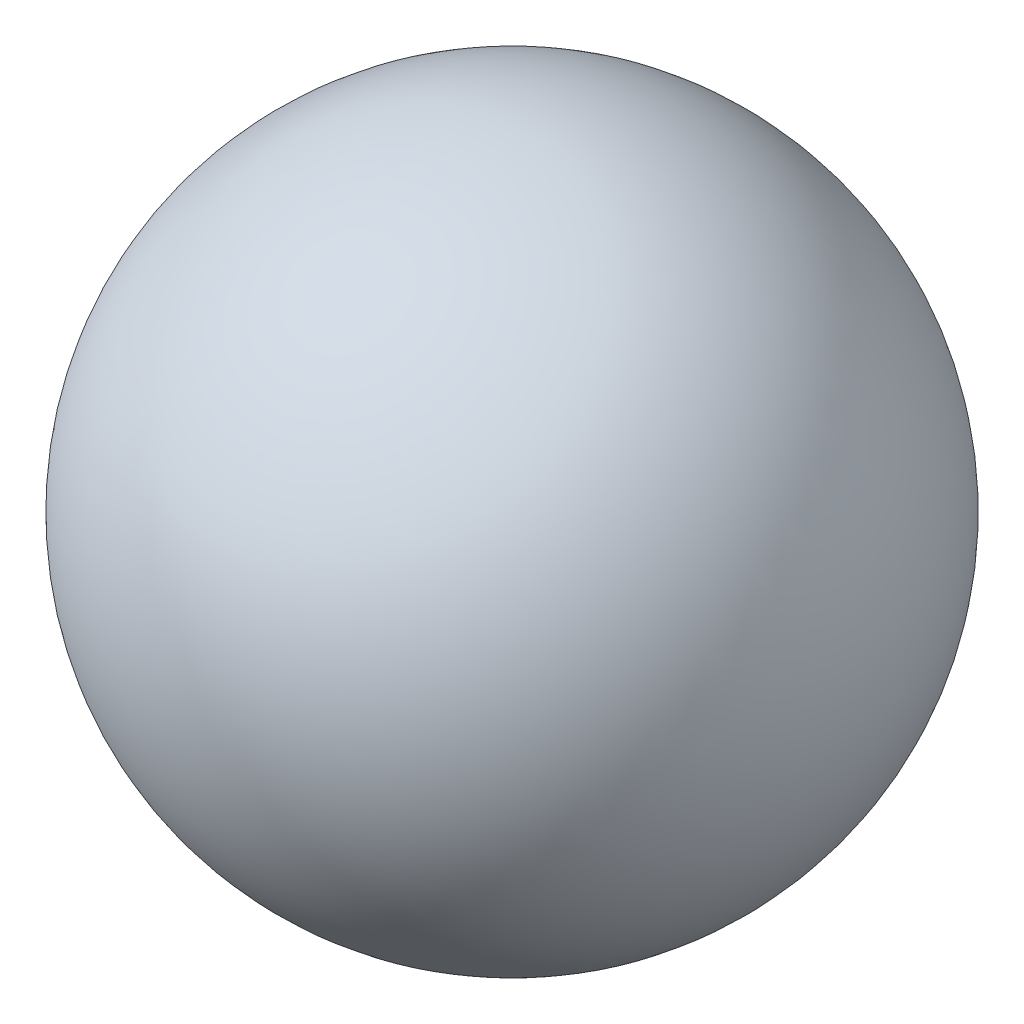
from build123d import *


with BuildPart() as part:
    # Esbo_o1 → Revolu_o1 (revolve)
    with BuildSketch(Plane.XY):
        with BuildLine():
            Line((0, 21.3), (0, -21.3))
            ThreePointArc((0, -21.3), (21.3, 0), (0, 21.3))
        make_face()
    revolve(axis=Axis((0, 21.3, 0), (0, -1, 0)))


solid = part.part
